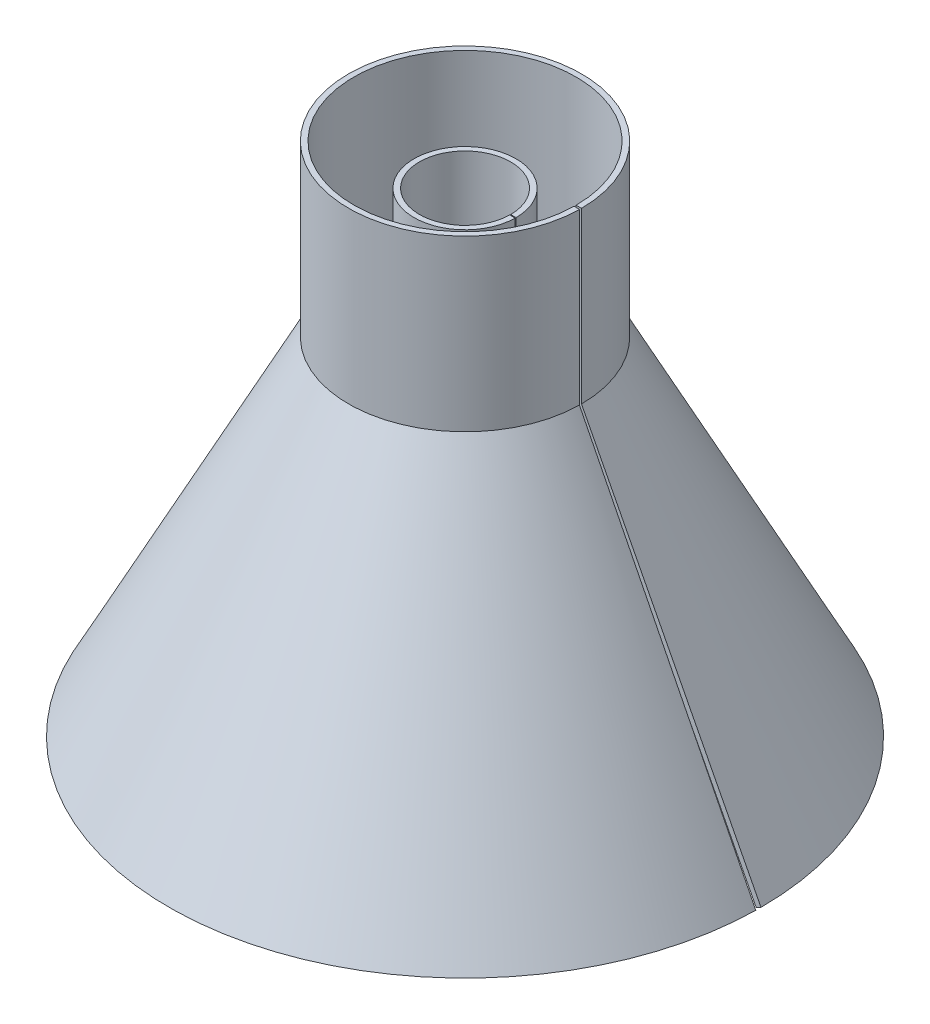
from build123d import *

# Parameters (mm, degrees)
REVOLVE_THIN8_ANGLE = 359
REVOLVE_THIN9_ANGLE = 359


with BuildPart() as part:
    # Sketch35 → Revolve-Thin8 (revolve)
    with BuildSketch(Plane.XY):
        Polygon((54.057315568, 0), (20.623594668, 64.485913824), (20.623594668, 96.190304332), (21.623594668, 96.190304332), (21.623594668, 64.729735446), (54.945089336, 0.460280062), align=None)
    revolve(axis=Axis((0, 0, 0), (0, 1, 0)), revolution_arc=REVOLVE_THIN8_ANGLE)


with BuildPart() as body_2:
    # Sketch42 → Revolve-Thin9 (revolve)
    with BuildSketch(Plane.XY):
        Polygon((28.826812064, 0), (8.466616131, 63.617281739), (8.466616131, 88.613957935), (9.466616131, 88.613957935), (9.466616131, 63.773402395), (29.779224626, 0.304811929), align=None)
    revolve(axis=Axis((0, 0, 0), (0, 1, 0)), revolution_arc=REVOLVE_THIN9_ANGLE)


solid = Compound([part.part, body_2.part])
